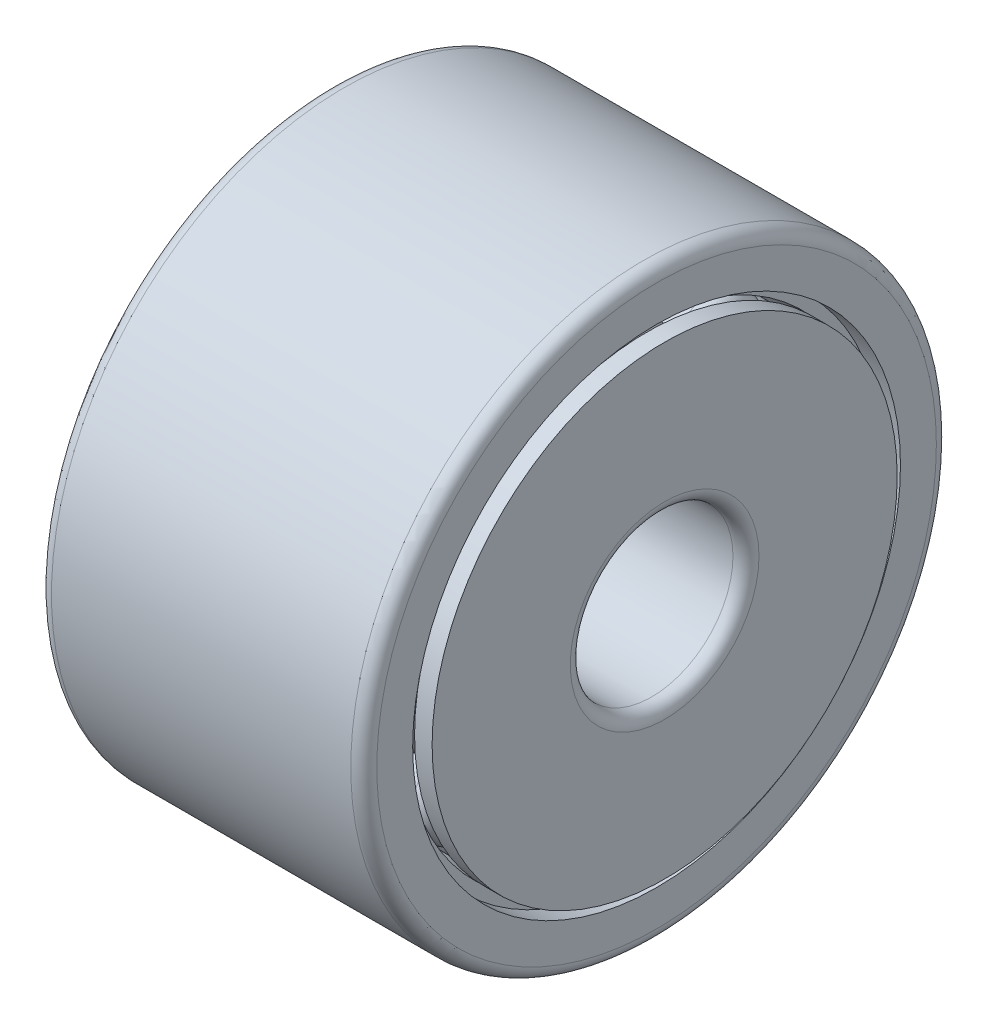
from build123d import *

# Parameters (mm, degrees)
ROLLERSDETAILED_COUNT = 12
ROLLERSDETAILED_ANGLE = 330


with BuildPart() as part:
    # OutRacSke → OuterRace (revolve)
    with BuildSketch(Plane.XY, mode=Mode.PRIVATE) as outerrace_sk:
        with BuildLine():
            Line((-14.022916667, 22.6933125), (-14.022916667, 23.802578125))
            Line((-14.022916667, 23.802578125), (-15.875, 23.802578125))
            Line((-15.875, 23.802578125), (-15.875, 27.305))
            ThreePointArc((-15.875, 27.305), (-15.503025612, 28.203025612), (-14.605, 28.575))
            Line((-14.605, 28.575), (14.605, 28.575))
            ThreePointArc((14.605, 28.575), (15.503025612, 28.203025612), (15.875, 27.305))
            Line((15.875, 27.305), (15.875, 23.802578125))
            Line((15.875, 23.802578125), (14.022916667, 23.802578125))
            Line((14.022916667, 23.802578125), (14.022916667, 22.6933125))
            Line((14.022916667, 22.6933125), (-14.022916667, 22.6933125))
        make_face()
    outerrace = revolve(outerrace_sk.sketch.rotate(Axis((-7.9375, 0, 0), (1, 0, 0)), 270), axis=Axis((-7.9375, 0, 0), (1, 0, 0)))

    # RolDetSke → RollerDetailed (revolve)
    with BuildSketch(Plane.XY, mode=Mode.PRIVATE) as rollerdetailed_sk:
        with BuildLine():
            Line((-14.022916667, 20.9187875), (-14.022916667, 18.25625))
            Line((-14.022916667, 18.25625), (14.022916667, 18.25625))
            Line((14.022916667, 18.25625), (14.022916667, 20.9187875))
            ThreePointArc((14.022916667, 20.9187875), (13.503023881, 22.173919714), (12.247891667, 22.6938125))
            Line((12.247891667, 22.6938125), (-12.247891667, 22.6938125))
            ThreePointArc((-12.247891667, 22.6938125), (-13.503023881, 22.173919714), (-14.022916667, 20.9187875))
        make_face()
    rollerdetailed = revolve(rollerdetailed_sk.sketch.rotate(Axis((-28.575, 18.25625, 0), (1, 0, 0)), 270), axis=Axis((-28.575, 18.25625, 0), (1, 0, 0)))

    # RollersDetailed: OuterRace, RollerDetailed ×12 about axis
    rollersdetailed_axis = Axis((-50, 0, 0), (1, 0, 0))
    add([outerrace.rotate(rollersdetailed_axis, i * ROLLERSDETAILED_ANGLE / (ROLLERSDETAILED_COUNT - 1)) for i in range(1, ROLLERSDETAILED_COUNT)])
    add([rollerdetailed.rotate(rollersdetailed_axis, i * ROLLERSDETAILED_ANGLE / (ROLLERSDETAILED_COUNT - 1)) for i in range(1, ROLLERSDETAILED_COUNT)])

    # InsRacSke → InnerRace (revolve)
    with BuildSketch(Plane.XY, mode=Mode.PRIVATE) as innerrace_sk:
        with BuildLine():
            Line((-14.948958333, 13.8191875), (-14.948958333, 22.6933125))
            Line((-14.948958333, 22.6933125), (-16.6624, 22.6933125))
            Line((-16.6624, 22.6933125), (-16.6624, 9.2075))
            ThreePointArc((-16.6624, 9.2075), (-16.290425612, 8.309474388), (-15.3924, 7.9375))
            Line((-15.3924, 7.9375), (-0.840026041, 7.9375))
            ThreePointArc((-0.840026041, 7.9375), (0, 8.255), (0.840026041, 7.9375))
            Line((0.840026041, 7.9375), (15.3924, 7.9375))
            ThreePointArc((15.3924, 7.9375), (16.290425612, 8.309474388), (16.6624, 9.2075))
            Line((16.6624, 9.2075), (16.6624, 22.6933125))
            Line((16.6624, 22.6933125), (14.948958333, 22.6933125))
            Line((14.948958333, 22.6933125), (14.948958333, 13.8191875))
            Line((14.948958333, 13.8191875), (-14.948958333, 13.8191875))
        make_face()
    revolve(innerrace_sk.sketch.rotate(Axis((-7.9375, 0, 0), (1, 0, 0)), 270), axis=Axis((-7.9375, 0, 0), (1, 0, 0)))


solid = part.part
